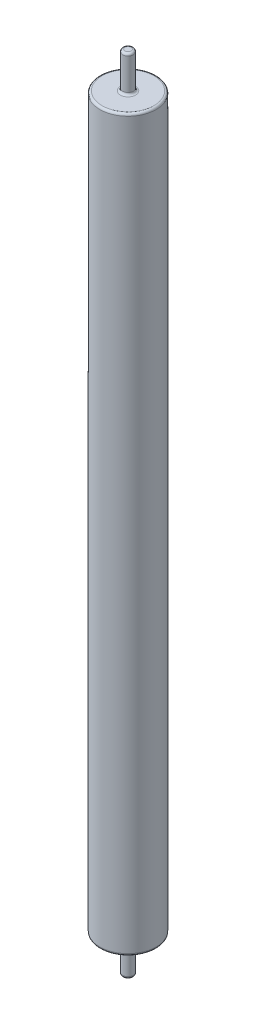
from build123d import *

# Parameters (mm, degrees)
SKETCH1_R           = 25
BOSS_EXTRUDE1_DEPTH = 712
CUT_EXTRUDE1_START  = -32
SKETCH2_R           = 25
SKETCH2_R_2         = 4.7625
CUT_EXTRUDE1_DEPTH  = 32
SKETCH3_R           = 25
SKETCH3_R_2         = 4.7625
CUT_EXTRUDE2_DEPTH  = 32
FILLET1_R           = 2
SKETCH4_R           = 1.5
CUT_EXTRUDE3_DEPTH  = 30


with BuildPart() as part:
    # Sketch1 → Boss-Extrude1 (new body)
    with BuildSketch(Plane(origin=(0, 0, 0), x_dir=(1, 0, 0), z_dir=(0, 1, 0))):
        with Locations(Location((0, 0, 0), (0, 0, 270))):
            Circle(SKETCH1_R)
    extrude(amount=BOSS_EXTRUDE1_DEPTH)

    # Sketch2 → Cut-Extrude1 (cut)
    with BuildSketch(Plane(origin=(0, 712, 0), x_dir=(1, 0, 0), z_dir=(0, 1, 0)).offset(CUT_EXTRUDE1_START)):
        with Locations(Location((0, 0, 0), (0, 0, 270))):
            Circle(SKETCH2_R)
        with Locations(Location((0, 0, 0), (0, 0, 270))):
            Circle(SKETCH2_R_2, mode=Mode.SUBTRACT)
    extrude(amount=CUT_EXTRUDE1_DEPTH, mode=Mode.SUBTRACT)

    # Sketch3 → Cut-Extrude2 (cut)
    with BuildSketch(Plane.XZ):
        with Locations(Location((0, 0, 0), (0, 0, 270))):
            Circle(SKETCH3_R)
        with Locations(Location((0, 0, 0), (0, 0, 90))):
            Circle(SKETCH3_R_2, mode=Mode.SUBTRACT)
    extrude(amount=-CUT_EXTRUDE2_DEPTH, mode=Mode.SUBTRACT)

    # Fillet1
    fillet1_edges = [part.edges().sort_by_distance(p)[0] for p in [
        (0, 32, -25),
        (0, 32, -4.7625),
        (0, 0, -4.7625),
        (0, 680, -25),
        (0, 680, -4.7625),
        (0, 712, -4.7625),
    ]]
    fillet(fillet1_edges, radius=FILLET1_R)

    # Sketch4 → Cut-Extrude3 (cut)
    with BuildSketch(Plane(origin=(0, 0, 0), x_dir=(0, 0, -1), z_dir=(1, 0, 0))):
        with Locations((3.570652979, 337.95)):
            Circle(SKETCH4_R)
    extrude(amount=-CUT_EXTRUDE3_DEPTH, mode=Mode.SUBTRACT)


solid = part.part
